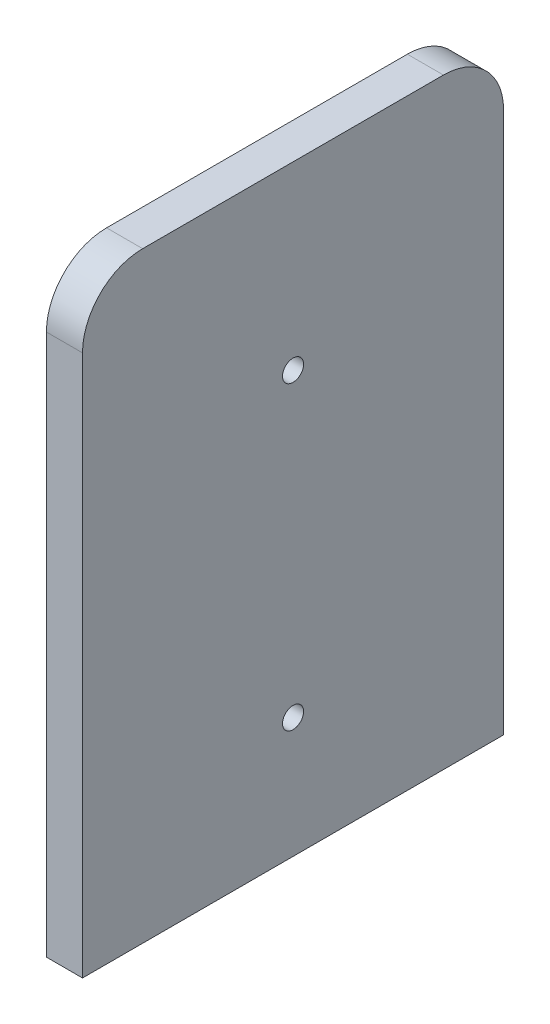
ISO-10303-21;
HEADER;
FILE_DESCRIPTION(('STEP AP214'),'2;1');
FILE_NAME('part.step','',(''),(''),'','','');
FILE_SCHEMA(('AUTOMOTIVE_DESIGN { 1 0 10303 214 1 1 1 1 }'));
ENDSEC;
DATA;
#1=APPLICATION_CONTEXT('core data for automotive mechanical design processes');
#2=APPLICATION_PROTOCOL_DEFINITION('international standard','automotive_design',2000,#1);
#3=PRODUCT_CONTEXT('',#1,'mechanical');
#4=PRODUCT('Part','Part','',(#3));
#5=PRODUCT_RELATED_PRODUCT_CATEGORY('part','',(#4));
#6=PRODUCT_DEFINITION_FORMATION('','',#4);
#7=PRODUCT_DEFINITION_CONTEXT('part definition',#1,'design');
#8=PRODUCT_DEFINITION('design','',#6,#7);
#9=PRODUCT_DEFINITION_SHAPE('','',#8);
#10=(LENGTH_UNIT() NAMED_UNIT(*) SI_UNIT(.MILLI.,.METRE.));
#11=(NAMED_UNIT(*) PLANE_ANGLE_UNIT() SI_UNIT($,.RADIAN.));
#12=(NAMED_UNIT(*) SI_UNIT($,.STERADIAN.) SOLID_ANGLE_UNIT());
#13=UNCERTAINTY_MEASURE_WITH_UNIT(LENGTH_MEASURE(1.E-05),#10,'distance_accuracy_value','');
#14=(GEOMETRIC_REPRESENTATION_CONTEXT(3) GLOBAL_UNCERTAINTY_ASSIGNED_CONTEXT((#13)) GLOBAL_UNIT_ASSIGNED_CONTEXT((#10,
#11,#12)) REPRESENTATION_CONTEXT('',''));
#15=CARTESIAN_POINT('',(0.,0.,0.));
#16=DIRECTION('',(0.,0.,1.));
#17=DIRECTION('',(1.,0.,0.));
#18=AXIS2_PLACEMENT_3D('',#15,#16,#17);
#19=CARTESIAN_POINT('',(6.,0.,0.));
#20=DIRECTION('',(0.,0.,-1.));
#21=DIRECTION('',(-1.,0.,0.));
#22=AXIS2_PLACEMENT_3D('',#19,#20,#21);
#23=PLANE('',#22);
#24=DIRECTION('',(0.,-1.,0.));
#25=VECTOR('',#24,1.);
#26=CARTESIAN_POINT('',(6.,0.,0.));
#27=LINE('',#26,#25);
#28=CARTESIAN_POINT('',(6.,90.,0.));
#29=VERTEX_POINT('',#28);
#30=CARTESIAN_POINT('',(6.,0.,0.));
#31=VERTEX_POINT('',#30);
#32=EDGE_CURVE('E120',#29,#31,#27,.T.);
#33=ORIENTED_EDGE('',*,*,#32,.F.);
#34=DIRECTION('',(-1.,0.,0.));
#35=VECTOR('',#34,1.);
#36=CARTESIAN_POINT('',(6.,90.,0.));
#37=LINE('',#36,#35);
#38=CARTESIAN_POINT('',(0.,90.,0.));
#39=VERTEX_POINT('',#38);
#40=EDGE_CURVE('E11',#29,#39,#37,.T.);
#41=ORIENTED_EDGE('',*,*,#40,.T.);
#42=DIRECTION('',(0.,-1.,0.));
#43=VECTOR('',#42,1.);
#44=CARTESIAN_POINT('',(0.,0.,0.));
#45=LINE('',#44,#43);
#46=CARTESIAN_POINT('',(0.,0.,0.));
#47=VERTEX_POINT('',#46);
#48=EDGE_CURVE('E119',#39,#47,#45,.T.);
#49=ORIENTED_EDGE('',*,*,#48,.T.);
#50=DIRECTION('',(-1.,0.,0.));
#51=VECTOR('',#50,1.);
#52=CARTESIAN_POINT('',(6.,0.,0.));
#53=LINE('',#52,#51);
#54=EDGE_CURVE('E139',#31,#47,#53,.T.);
#55=ORIENTED_EDGE('',*,*,#54,.F.);
#56=EDGE_LOOP('',(#33,#41,#49,#55));
#57=FACE_BOUND('',#56,.T.);
#58=ADVANCED_FACE('F30',(#57),#23,.F.);
#59=CARTESIAN_POINT('',(6.,0.,0.));
#60=DIRECTION('',(0.,1.,0.));
#61=DIRECTION('',(0.,0.,1.));
#62=AXIS2_PLACEMENT_3D('',#59,#60,#61);
#63=PLANE('',#62);
#64=CARTESIAN_POINT('',(3.,0.,-20.));
#65=DIRECTION('',(0.,-1.,0.));
#66=DIRECTION('',(0.,0.,-1.));
#67=AXIS2_PLACEMENT_3D('',#64,#65,#66);
#68=CIRCLE('',#67,1.5);
#69=CARTESIAN_POINT('',(3.,0.,-21.5));
#70=VERTEX_POINT('',#69);
#71=EDGE_CURVE('E246',#70,#70,#68,.T.);
#72=ORIENTED_EDGE('',*,*,#71,.F.);
#73=EDGE_LOOP('',(#72));
#74=FACE_BOUND('',#73,.T.);
#75=CARTESIAN_POINT('',(3.00000000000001,0.,-50.));
#76=DIRECTION('',(0.,-1.,0.));
#77=DIRECTION('',(0.,0.,-1.));
#78=AXIS2_PLACEMENT_3D('',#75,#76,#77);
#79=CIRCLE('',#78,1.5);
#80=CARTESIAN_POINT('',(3.00000000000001,0.,-51.5));
#81=VERTEX_POINT('',#80);
#82=EDGE_CURVE('E100',#81,#81,#79,.T.);
#83=ORIENTED_EDGE('',*,*,#82,.F.);
#84=EDGE_LOOP('',(#83));
#85=FACE_BOUND('',#84,.T.);
#86=DIRECTION('',(0.,0.,-1.));
#87=VECTOR('',#86,1.);
#88=CARTESIAN_POINT('',(0.,0.,0.));
#89=LINE('',#88,#87);
#90=CARTESIAN_POINT('',(0.,0.,-70.));
#91=VERTEX_POINT('',#90);
#92=EDGE_CURVE('E131',#47,#91,#89,.T.);
#93=ORIENTED_EDGE('',*,*,#92,.T.);
#94=DIRECTION('',(-1.,0.,0.));
#95=VECTOR('',#94,1.);
#96=CARTESIAN_POINT('',(6.,0.,-70.));
#97=LINE('',#96,#95);
#98=CARTESIAN_POINT('',(6.,0.,-70.));
#99=VERTEX_POINT('',#98);
#100=EDGE_CURVE('E129',#99,#91,#97,.T.);
#101=ORIENTED_EDGE('',*,*,#100,.F.);
#102=DIRECTION('',(0.,0.,-1.));
#103=VECTOR('',#102,1.);
#104=CARTESIAN_POINT('',(6.,0.,0.));
#105=LINE('',#104,#103);
#106=EDGE_CURVE('E122',#31,#99,#105,.T.);
#107=ORIENTED_EDGE('',*,*,#106,.F.);
#108=ORIENTED_EDGE('',*,*,#54,.T.);
#109=EDGE_LOOP('',(#93,#101,#107,#108));
#110=FACE_BOUND('',#109,.T.);
#111=ADVANCED_FACE('F170',(#74,#85,#110),#63,.F.);
#112=CARTESIAN_POINT('',(6.,0.,-70.));
#113=DIRECTION('',(0.,0.,1.));
#114=DIRECTION('',(1.,0.,0.));
#115=AXIS2_PLACEMENT_3D('',#112,#113,#114);
#116=PLANE('',#115);
#117=DIRECTION('',(0.,1.,0.));
#118=VECTOR('',#117,1.);
#119=CARTESIAN_POINT('',(0.,0.,-70.));
#120=LINE('',#119,#118);
#121=CARTESIAN_POINT('',(0.,90.,-70.));
#122=VERTEX_POINT('',#121);
#123=EDGE_CURVE('E133',#91,#122,#120,.T.);
#124=ORIENTED_EDGE('',*,*,#123,.T.);
#125=DIRECTION('',(-1.,0.,0.));
#126=VECTOR('',#125,1.);
#127=CARTESIAN_POINT('',(6.,90.,-70.));
#128=LINE('',#127,#126);
#129=CARTESIAN_POINT('',(6.,90.,-70.));
#130=VERTEX_POINT('',#129);
#131=EDGE_CURVE('E53',#122,#130,#128,.F.);
#132=ORIENTED_EDGE('',*,*,#131,.T.);
#133=DIRECTION('',(0.,1.,0.));
#134=VECTOR('',#133,1.);
#135=CARTESIAN_POINT('',(6.,0.,-70.));
#136=LINE('',#135,#134);
#137=EDGE_CURVE('E125',#99,#130,#136,.T.);
#138=ORIENTED_EDGE('',*,*,#137,.F.);
#139=ORIENTED_EDGE('',*,*,#100,.T.);
#140=EDGE_LOOP('',(#124,#132,#138,#139));
#141=FACE_BOUND('',#140,.T.);
#142=ADVANCED_FACE('F166',(#141),#116,.F.);
#143=CARTESIAN_POINT('',(6.,100.,0.));
#144=DIRECTION('',(0.,-1.,0.));
#145=DIRECTION('',(0.,0.,-1.));
#146=AXIS2_PLACEMENT_3D('',#143,#144,#145);
#147=PLANE('',#146);
#148=DIRECTION('',(0.,0.,1.));
#149=VECTOR('',#148,1.);
#150=CARTESIAN_POINT('',(6.,100.,0.));
#151=LINE('',#150,#149);
#152=CARTESIAN_POINT('',(6.,100.,-60.));
#153=VERTEX_POINT('',#152);
#154=CARTESIAN_POINT('',(6.,100.,-10.));
#155=VERTEX_POINT('',#154);
#156=EDGE_CURVE('E127',#153,#155,#151,.T.);
#157=ORIENTED_EDGE('',*,*,#156,.F.);
#158=DIRECTION('',(-1.,0.,0.));
#159=VECTOR('',#158,1.);
#160=CARTESIAN_POINT('',(6.,100.,-60.));
#161=LINE('',#160,#159);
#162=CARTESIAN_POINT('',(0.,100.,-60.));
#163=VERTEX_POINT('',#162);
#164=EDGE_CURVE('E144',#153,#163,#161,.T.);
#165=ORIENTED_EDGE('',*,*,#164,.T.);
#166=DIRECTION('',(0.,0.,1.));
#167=VECTOR('',#166,1.);
#168=CARTESIAN_POINT('',(0.,100.,0.));
#169=LINE('',#168,#167);
#170=CARTESIAN_POINT('',(0.,100.,-10.));
#171=VERTEX_POINT('',#170);
#172=EDGE_CURVE('E123',#163,#171,#169,.T.);
#173=ORIENTED_EDGE('',*,*,#172,.T.);
#174=DIRECTION('',(-1.,0.,0.));
#175=VECTOR('',#174,1.);
#176=CARTESIAN_POINT('',(6.,100.,-10.));
#177=LINE('',#176,#175);
#178=EDGE_CURVE('E142',#171,#155,#177,.F.);
#179=ORIENTED_EDGE('',*,*,#178,.T.);
#180=EDGE_LOOP('',(#157,#165,#173,#179));
#181=FACE_BOUND('',#180,.T.);
#182=ADVANCED_FACE('F158',(#181),#147,.F.);
#183=CARTESIAN_POINT('',(6.,100.,0.));
#184=DIRECTION('',(-1.,0.,0.));
#185=DIRECTION('',(0.,0.,1.));
#186=AXIS2_PLACEMENT_3D('',#183,#184,#185);
#187=PLANE('',#186);
#188=CARTESIAN_POINT('',(6.,20.,-35.));
#189=DIRECTION('',(1.,0.,0.));
#190=DIRECTION('',(0.,0.,-1.));
#191=AXIS2_PLACEMENT_3D('',#188,#189,#190);
#192=CIRCLE('',#191,1.75);
#193=CARTESIAN_POINT('',(6.,20.,-36.75));
#194=VERTEX_POINT('',#193);
#195=EDGE_CURVE('E238',#194,#194,#192,.T.);
#196=ORIENTED_EDGE('',*,*,#195,.F.);
#197=EDGE_LOOP('',(#196));
#198=FACE_BOUND('',#197,.T.);
#199=CARTESIAN_POINT('',(6.,70.,-35.));
#200=DIRECTION('',(1.,0.,0.));
#201=DIRECTION('',(0.,0.,-1.));
#202=AXIS2_PLACEMENT_3D('',#199,#200,#201);
#203=CIRCLE('',#202,1.75);
#204=CARTESIAN_POINT('',(6.,70.,-36.75));
#205=VERTEX_POINT('',#204);
#206=EDGE_CURVE('E240',#205,#205,#203,.T.);
#207=ORIENTED_EDGE('',*,*,#206,.F.);
#208=EDGE_LOOP('',(#207));
#209=FACE_BOUND('',#208,.T.);
#210=ORIENTED_EDGE('',*,*,#137,.T.);
#211=CARTESIAN_POINT('',(6.,90.,-60.));
#212=DIRECTION('',(-1.,0.,0.));
#213=DIRECTION('',(0.,0.,1.));
#214=AXIS2_PLACEMENT_3D('',#211,#212,#213);
#215=CIRCLE('',#214,10.);
#216=EDGE_CURVE('E38',#130,#153,#215,.F.);
#217=ORIENTED_EDGE('',*,*,#216,.T.);
#218=ORIENTED_EDGE('',*,*,#156,.T.);
#219=CARTESIAN_POINT('',(6.,90.,-10.));
#220=DIRECTION('',(-1.,0.,0.));
#221=DIRECTION('',(0.,0.,1.));
#222=AXIS2_PLACEMENT_3D('',#219,#220,#221);
#223=CIRCLE('',#222,10.);
#224=EDGE_CURVE('E45',#155,#29,#223,.F.);
#225=ORIENTED_EDGE('',*,*,#224,.T.);
#226=ORIENTED_EDGE('',*,*,#32,.T.);
#227=ORIENTED_EDGE('',*,*,#106,.T.);
#228=EDGE_LOOP('',(#210,#217,#218,#225,#226,#227));
#229=FACE_BOUND('',#228,.T.);
#230=ADVANCED_FACE('F154',(#198,#209,#229),#187,.F.);
#231=CARTESIAN_POINT('',(0.,100.,0.));
#232=DIRECTION('',(-1.,0.,0.));
#233=DIRECTION('',(0.,0.,1.));
#234=AXIS2_PLACEMENT_3D('',#231,#232,#233);
#235=PLANE('',#234);
#236=CARTESIAN_POINT('',(0.,20.,-35.));
#237=DIRECTION('',(1.,0.,0.));
#238=DIRECTION('',(0.,0.,-1.));
#239=AXIS2_PLACEMENT_3D('',#236,#237,#238);
#240=CIRCLE('',#239,1.75);
#241=CARTESIAN_POINT('',(0.,20.,-36.75));
#242=VERTEX_POINT('',#241);
#243=EDGE_CURVE('E235',#242,#242,#240,.T.);
#244=ORIENTED_EDGE('',*,*,#243,.T.);
#245=EDGE_LOOP('',(#244));
#246=FACE_BOUND('',#245,.T.);
#247=CARTESIAN_POINT('',(0.,70.,-35.));
#248=DIRECTION('',(1.,0.,0.));
#249=DIRECTION('',(0.,0.,-1.));
#250=AXIS2_PLACEMENT_3D('',#247,#248,#249);
#251=CIRCLE('',#250,1.75);
#252=CARTESIAN_POINT('',(0.,70.,-36.75));
#253=VERTEX_POINT('',#252);
#254=EDGE_CURVE('E243',#253,#253,#251,.T.);
#255=ORIENTED_EDGE('',*,*,#254,.T.);
#256=EDGE_LOOP('',(#255));
#257=FACE_BOUND('',#256,.T.);
#258=ORIENTED_EDGE('',*,*,#172,.F.);
#259=CARTESIAN_POINT('',(0.,90.,-60.));
#260=DIRECTION('',(-1.,0.,0.));
#261=DIRECTION('',(0.,0.,1.));
#262=AXIS2_PLACEMENT_3D('',#259,#260,#261);
#263=CIRCLE('',#262,10.);
#264=EDGE_CURVE('E149',#163,#122,#263,.T.);
#265=ORIENTED_EDGE('',*,*,#264,.T.);
#266=ORIENTED_EDGE('',*,*,#123,.F.);
#267=ORIENTED_EDGE('',*,*,#92,.F.);
#268=ORIENTED_EDGE('',*,*,#48,.F.);
#269=CARTESIAN_POINT('',(0.,90.,-10.));
#270=DIRECTION('',(-1.,0.,0.));
#271=DIRECTION('',(0.,0.,1.));
#272=AXIS2_PLACEMENT_3D('',#269,#270,#271);
#273=CIRCLE('',#272,10.);
#274=EDGE_CURVE('E147',#39,#171,#273,.T.);
#275=ORIENTED_EDGE('',*,*,#274,.T.);
#276=EDGE_LOOP('',(#258,#265,#266,#267,#268,#275));
#277=FACE_BOUND('',#276,.T.);
#278=ADVANCED_FACE('F164',(#246,#257,#277),#235,.T.);
#279=CARTESIAN_POINT('',(3.00000000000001,10.,-50.));
#280=DIRECTION('',(0.,-1.,0.));
#281=DIRECTION('',(0.,0.,-1.));
#282=AXIS2_PLACEMENT_3D('',#279,#280,#281);
#283=CONICAL_SURFACE('',#282,1.25,1.02974425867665);
#284=CARTESIAN_POINT('',(3.,10.7510757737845,-50.));
#285=VERTEX_POINT('',#284);
#286=VERTEX_LOOP('',#285);
#287=FACE_BOUND('',#286,.T.);
#288=CARTESIAN_POINT('',(3.00000000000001,10.,-50.));
#289=DIRECTION('',(0.,-1.,0.));
#290=DIRECTION('',(0.,0.,-1.));
#291=AXIS2_PLACEMENT_3D('',#288,#289,#290);
#292=CIRCLE('',#291,1.25);
#293=CARTESIAN_POINT('',(3.00000000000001,10.,-51.25));
#294=VERTEX_POINT('',#293);
#295=EDGE_CURVE('E116',#294,#294,#292,.T.);
#296=ORIENTED_EDGE('',*,*,#295,.T.);
#297=EDGE_LOOP('',(#296));
#298=FACE_BOUND('',#297,.T.);
#299=ADVANCED_FACE('F195',(#287,#298),#283,.F.);
#300=CARTESIAN_POINT('',(3.00000000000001,0.,-50.));
#301=DIRECTION('',(0.,-1.,0.));
#302=DIRECTION('',(0.,0.,-1.));
#303=AXIS2_PLACEMENT_3D('',#300,#301,#302);
#304=CYLINDRICAL_SURFACE('',#303,1.25);
#305=ORIENTED_EDGE('',*,*,#295,.F.);
#306=EDGE_LOOP('',(#305));
#307=FACE_BOUND('',#306,.T.);
#308=CARTESIAN_POINT('',(3.00000000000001,6.,-50.));
#309=DIRECTION('',(0.,-1.,0.));
#310=DIRECTION('',(0.,0.,-1.));
#311=AXIS2_PLACEMENT_3D('',#308,#309,#310);
#312=CIRCLE('',#311,1.25);
#313=CARTESIAN_POINT('',(3.00000000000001,6.,-51.25));
#314=VERTEX_POINT('',#313);
#315=EDGE_CURVE('E113',#314,#314,#312,.T.);
#316=ORIENTED_EDGE('',*,*,#315,.T.);
#317=EDGE_LOOP('',(#316));
#318=FACE_BOUND('',#317,.T.);
#319=ADVANCED_FACE('F202',(#307,#318),#304,.F.);
#320=CARTESIAN_POINT('',(4.25,6.,-50.));
#321=DIRECTION('',(0.,1.,0.));
#322=DIRECTION('',(0.,0.,1.));
#323=AXIS2_PLACEMENT_3D('',#320,#321,#322);
#324=PLANE('',#323);
#325=ORIENTED_EDGE('',*,*,#315,.F.);
#326=EDGE_LOOP('',(#325));
#327=FACE_BOUND('',#326,.T.);
#328=CARTESIAN_POINT('',(3.00000000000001,6.,-50.));
#329=DIRECTION('',(0.,-1.,0.));
#330=DIRECTION('',(0.,0.,-1.));
#331=AXIS2_PLACEMENT_3D('',#328,#329,#330);
#332=CIRCLE('',#331,1.5);
#333=CARTESIAN_POINT('',(3.00000000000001,6.,-51.5));
#334=VERTEX_POINT('',#333);
#335=EDGE_CURVE('E104',#334,#334,#332,.T.);
#336=ORIENTED_EDGE('',*,*,#335,.T.);
#337=EDGE_LOOP('',(#336));
#338=FACE_BOUND('',#337,.T.);
#339=ADVANCED_FACE('F206',(#327,#338),#324,.F.);
#340=CARTESIAN_POINT('',(3.00000000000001,0.,-50.));
#341=DIRECTION('',(0.,-1.,0.));
#342=DIRECTION('',(0.,0.,-1.));
#343=AXIS2_PLACEMENT_3D('',#340,#341,#342);
#344=CYLINDRICAL_SURFACE('',#343,1.5);
#345=ORIENTED_EDGE('',*,*,#335,.F.);
#346=EDGE_LOOP('',(#345));
#347=FACE_BOUND('',#346,.T.);
#348=ORIENTED_EDGE('',*,*,#82,.T.);
#349=EDGE_LOOP('',(#348));
#350=FACE_BOUND('',#349,.T.);
#351=ADVANCED_FACE('F94',(#347,#350),#344,.F.);
#352=CARTESIAN_POINT('',(3.,10.,-20.));
#353=DIRECTION('',(0.,-1.,0.));
#354=DIRECTION('',(0.,0.,-1.));
#355=AXIS2_PLACEMENT_3D('',#352,#353,#354);
#356=CONICAL_SURFACE('',#355,1.25,1.02974425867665);
#357=CARTESIAN_POINT('',(3.,10.7510757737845,-20.));
#358=VERTEX_POINT('',#357);
#359=VERTEX_LOOP('',#358);
#360=FACE_BOUND('',#359,.T.);
#361=CARTESIAN_POINT('',(3.,10.,-20.));
#362=DIRECTION('',(0.,-1.,0.));
#363=DIRECTION('',(0.,0.,-1.));
#364=AXIS2_PLACEMENT_3D('',#361,#362,#363);
#365=CIRCLE('',#364,1.25);
#366=CARTESIAN_POINT('',(3.,10.,-21.25));
#367=VERTEX_POINT('',#366);
#368=EDGE_CURVE('E98',#367,#367,#365,.T.);
#369=ORIENTED_EDGE('',*,*,#368,.T.);
#370=EDGE_LOOP('',(#369));
#371=FACE_BOUND('',#370,.T.);
#372=ADVANCED_FACE('F90',(#360,#371),#356,.F.);
#373=CARTESIAN_POINT('',(3.,0.,-20.));
#374=DIRECTION('',(0.,-1.,0.));
#375=DIRECTION('',(0.,0.,-1.));
#376=AXIS2_PLACEMENT_3D('',#373,#374,#375);
#377=CYLINDRICAL_SURFACE('',#376,1.25);
#378=ORIENTED_EDGE('',*,*,#368,.F.);
#379=EDGE_LOOP('',(#378));
#380=FACE_BOUND('',#379,.T.);
#381=CARTESIAN_POINT('',(3.,6.,-20.));
#382=DIRECTION('',(0.,-1.,0.));
#383=DIRECTION('',(0.,0.,-1.));
#384=AXIS2_PLACEMENT_3D('',#381,#382,#383);
#385=CIRCLE('',#384,1.25);
#386=CARTESIAN_POINT('',(3.,6.,-21.25));
#387=VERTEX_POINT('',#386);
#388=EDGE_CURVE('E101',#387,#387,#385,.T.);
#389=ORIENTED_EDGE('',*,*,#388,.T.);
#390=EDGE_LOOP('',(#389));
#391=FACE_BOUND('',#390,.T.);
#392=ADVANCED_FACE('F93',(#380,#391),#377,.F.);
#393=CARTESIAN_POINT('',(4.25,6.,-20.));
#394=DIRECTION('',(0.,1.,0.));
#395=DIRECTION('',(0.,0.,1.));
#396=AXIS2_PLACEMENT_3D('',#393,#394,#395);
#397=PLANE('',#396);
#398=ORIENTED_EDGE('',*,*,#388,.F.);
#399=EDGE_LOOP('',(#398));
#400=FACE_BOUND('',#399,.T.);
#401=CARTESIAN_POINT('',(3.,6.,-20.));
#402=DIRECTION('',(0.,-1.,0.));
#403=DIRECTION('',(0.,0.,-1.));
#404=AXIS2_PLACEMENT_3D('',#401,#402,#403);
#405=CIRCLE('',#404,1.5);
#406=CARTESIAN_POINT('',(3.,6.,-21.5));
#407=VERTEX_POINT('',#406);
#408=EDGE_CURVE('E107',#407,#407,#405,.T.);
#409=ORIENTED_EDGE('',*,*,#408,.T.);
#410=EDGE_LOOP('',(#409));
#411=FACE_BOUND('',#410,.T.);
#412=ADVANCED_FACE('F216',(#400,#411),#397,.F.);
#413=CARTESIAN_POINT('',(3.,0.,-20.));
#414=DIRECTION('',(0.,-1.,0.));
#415=DIRECTION('',(0.,0.,-1.));
#416=AXIS2_PLACEMENT_3D('',#413,#414,#415);
#417=CYLINDRICAL_SURFACE('',#416,1.5);
#418=ORIENTED_EDGE('',*,*,#408,.F.);
#419=EDGE_LOOP('',(#418));
#420=FACE_BOUND('',#419,.T.);
#421=ORIENTED_EDGE('',*,*,#71,.T.);
#422=EDGE_LOOP('',(#421));
#423=FACE_BOUND('',#422,.T.);
#424=ADVANCED_FACE('F219',(#420,#423),#417,.F.);
#425=CARTESIAN_POINT('',(0.,70.,-35.));
#426=DIRECTION('',(1.,0.,0.));
#427=DIRECTION('',(0.,0.,-1.));
#428=AXIS2_PLACEMENT_3D('',#425,#426,#427);
#429=CYLINDRICAL_SURFACE('',#428,1.75);
#430=ORIENTED_EDGE('',*,*,#254,.F.);
#431=EDGE_LOOP('',(#430));
#432=FACE_BOUND('',#431,.T.);
#433=ORIENTED_EDGE('',*,*,#206,.T.);
#434=EDGE_LOOP('',(#433));
#435=FACE_BOUND('',#434,.T.);
#436=ADVANCED_FACE('F223',(#432,#435),#429,.F.);
#437=CARTESIAN_POINT('',(0.,20.,-35.));
#438=DIRECTION('',(1.,0.,0.));
#439=DIRECTION('',(0.,0.,-1.));
#440=AXIS2_PLACEMENT_3D('',#437,#438,#439);
#441=CYLINDRICAL_SURFACE('',#440,1.75);
#442=ORIENTED_EDGE('',*,*,#243,.F.);
#443=EDGE_LOOP('',(#442));
#444=FACE_BOUND('',#443,.T.);
#445=ORIENTED_EDGE('',*,*,#195,.T.);
#446=EDGE_LOOP('',(#445));
#447=FACE_BOUND('',#446,.T.);
#448=ADVANCED_FACE('F180',(#444,#447),#441,.F.);
#449=CARTESIAN_POINT('',(6.,90.,-60.));
#450=DIRECTION('',(-1.,0.,0.));
#451=DIRECTION('',(0.,0.,1.));
#452=AXIS2_PLACEMENT_3D('',#449,#450,#451);
#453=CYLINDRICAL_SURFACE('',#452,10.);
#454=ORIENTED_EDGE('',*,*,#216,.F.);
#455=ORIENTED_EDGE('',*,*,#131,.F.);
#456=ORIENTED_EDGE('',*,*,#264,.F.);
#457=ORIENTED_EDGE('',*,*,#164,.F.);
#458=EDGE_LOOP('',(#454,#455,#456,#457));
#459=FACE_BOUND('',#458,.T.);
#460=ADVANCED_FACE('F161',(#459),#453,.T.);
#461=CARTESIAN_POINT('',(6.,90.,-10.));
#462=DIRECTION('',(-1.,0.,0.));
#463=DIRECTION('',(0.,0.,1.));
#464=AXIS2_PLACEMENT_3D('',#461,#462,#463);
#465=CYLINDRICAL_SURFACE('',#464,10.);
#466=ORIENTED_EDGE('',*,*,#224,.F.);
#467=ORIENTED_EDGE('',*,*,#178,.F.);
#468=ORIENTED_EDGE('',*,*,#274,.F.);
#469=ORIENTED_EDGE('',*,*,#40,.F.);
#470=EDGE_LOOP('',(#466,#467,#468,#469));
#471=FACE_BOUND('',#470,.T.);
#472=ADVANCED_FACE('F32',(#471),#465,.T.);
#473=CLOSED_SHELL('',(#58,#111,#142,#182,#230,#278,#299,#319,#339,#351,#372,#392,#412,#424,#436,
#448,#460,#472));
#474=MANIFOLD_SOLID_BREP('B2',#473);
#475=ADVANCED_BREP_SHAPE_REPRESENTATION('',(#18,#474),#14);
#476=SHAPE_DEFINITION_REPRESENTATION(#9,#475);
ENDSEC;
END-ISO-10303-21;
